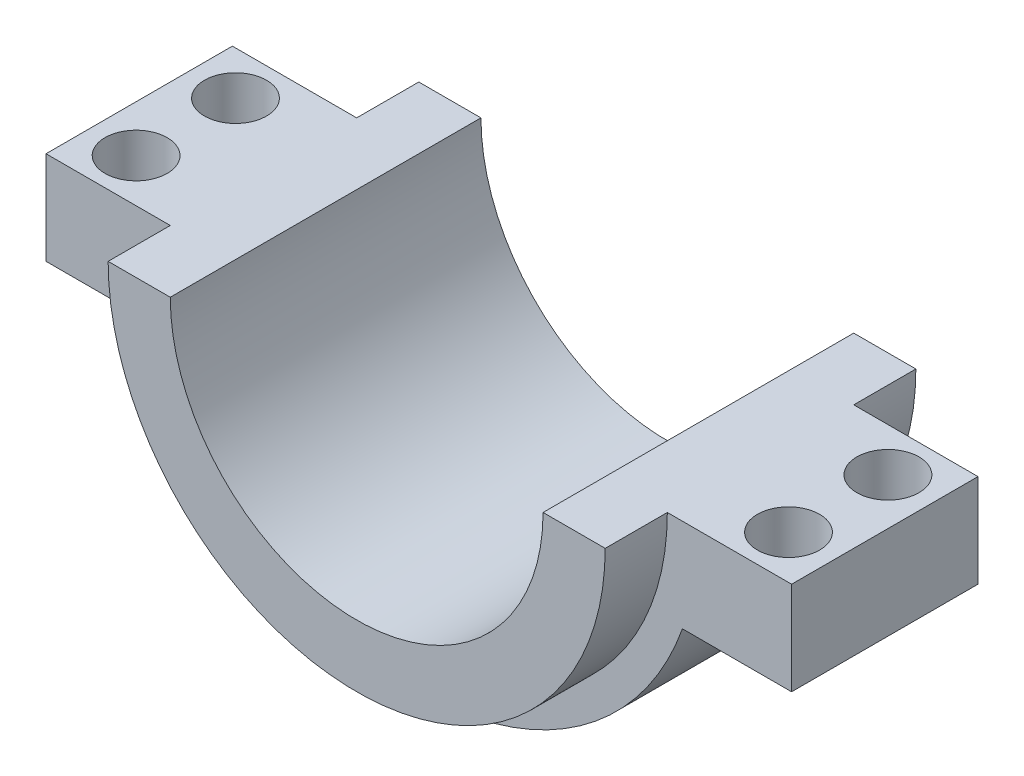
ISO-10303-21;
HEADER;
FILE_DESCRIPTION(('STEP AP214'),'2;1');
FILE_NAME('part.step','',(''),(''),'','','');
FILE_SCHEMA(('AUTOMOTIVE_DESIGN { 1 0 10303 214 1 1 1 1 }'));
ENDSEC;
DATA;
#1=APPLICATION_CONTEXT('core data for automotive mechanical design processes');
#2=APPLICATION_PROTOCOL_DEFINITION('international standard','automotive_design',2000,#1);
#3=PRODUCT_CONTEXT('',#1,'mechanical');
#4=PRODUCT('Part','Part','',(#3));
#5=PRODUCT_RELATED_PRODUCT_CATEGORY('part','',(#4));
#6=PRODUCT_DEFINITION_FORMATION('','',#4);
#7=PRODUCT_DEFINITION_CONTEXT('part definition',#1,'design');
#8=PRODUCT_DEFINITION('design','',#6,#7);
#9=PRODUCT_DEFINITION_SHAPE('','',#8);
#10=(LENGTH_UNIT() NAMED_UNIT(*) SI_UNIT(.MILLI.,.METRE.));
#11=(NAMED_UNIT(*) PLANE_ANGLE_UNIT() SI_UNIT($,.RADIAN.));
#12=(NAMED_UNIT(*) SI_UNIT($,.STERADIAN.) SOLID_ANGLE_UNIT());
#13=UNCERTAINTY_MEASURE_WITH_UNIT(LENGTH_MEASURE(1.E-05),#10,'distance_accuracy_value','');
#14=(GEOMETRIC_REPRESENTATION_CONTEXT(3) GLOBAL_UNCERTAINTY_ASSIGNED_CONTEXT((#13)) GLOBAL_UNIT_ASSIGNED_CONTEXT((#10,
#11,#12)) REPRESENTATION_CONTEXT('',''));
#15=CARTESIAN_POINT('',(0.,0.,0.));
#16=DIRECTION('',(0.,0.,1.));
#17=DIRECTION('',(1.,0.,0.));
#18=AXIS2_PLACEMENT_3D('',#15,#16,#17);
#19=CARTESIAN_POINT('',(0.,0.,15.));
#20=DIRECTION('',(0.,-1.,0.));
#21=DIRECTION('',(1.,0.,0.));
#22=AXIS2_PLACEMENT_3D('',#19,#20,#21);
#23=PLANE('',#22);
#24=CARTESIAN_POINT('',(-52.5,0.,-8.));
#25=DIRECTION('',(0.,1.,0.));
#26=DIRECTION('',(-1.,0.,0.));
#27=AXIS2_PLACEMENT_3D('',#24,#25,#26);
#28=CIRCLE('',#27,5.);
#29=CARTESIAN_POINT('',(-57.5,0.,-8.));
#30=VERTEX_POINT('',#29);
#31=EDGE_CURVE('E160',#30,#30,#28,.T.);
#32=ORIENTED_EDGE('',*,*,#31,.F.);
#33=EDGE_LOOP('',(#32));
#34=FACE_BOUND('',#33,.T.);
#35=CARTESIAN_POINT('',(-52.5,0.,8.));
#36=DIRECTION('',(0.,1.,0.));
#37=DIRECTION('',(-1.,0.,0.));
#38=AXIS2_PLACEMENT_3D('',#35,#36,#37);
#39=CIRCLE('',#38,5.);
#40=CARTESIAN_POINT('',(-57.5,0.,8.));
#41=VERTEX_POINT('',#40);
#42=EDGE_CURVE('E166',#41,#41,#39,.T.);
#43=ORIENTED_EDGE('',*,*,#42,.F.);
#44=EDGE_LOOP('',(#43));
#45=FACE_BOUND('',#44,.T.);
#46=DIRECTION('',(-1.,0.,0.));
#47=VECTOR('',#46,1.);
#48=CARTESIAN_POINT('',(0.,0.,-15.));
#49=LINE('',#48,#47);
#50=CARTESIAN_POINT('',(-40.,0.,-15.));
#51=VERTEX_POINT('',#50);
#52=CARTESIAN_POINT('',(-60.,0.,-15.));
#53=VERTEX_POINT('',#52);
#54=EDGE_CURVE('E137',#51,#53,#49,.T.);
#55=ORIENTED_EDGE('',*,*,#54,.T.);
#56=DIRECTION('',(0.,0.,-1.));
#57=VECTOR('',#56,1.);
#58=CARTESIAN_POINT('',(-60.,0.,15.));
#59=LINE('',#58,#57);
#60=CARTESIAN_POINT('',(-60.,0.,15.));
#61=VERTEX_POINT('',#60);
#62=EDGE_CURVE('E11',#61,#53,#59,.T.);
#63=ORIENTED_EDGE('',*,*,#62,.F.);
#64=DIRECTION('',(-1.,0.,0.));
#65=VECTOR('',#64,1.);
#66=CARTESIAN_POINT('',(0.,0.,15.));
#67=LINE('',#66,#65);
#68=CARTESIAN_POINT('',(-40.,0.,15.));
#69=VERTEX_POINT('',#68);
#70=EDGE_CURVE('E94',#69,#61,#67,.T.);
#71=ORIENTED_EDGE('',*,*,#70,.F.);
#72=DIRECTION('',(0.,0.,-1.));
#73=VECTOR('',#72,1.);
#74=CARTESIAN_POINT('',(-40.,0.,25.));
#75=LINE('',#74,#73);
#76=CARTESIAN_POINT('',(-40.,0.,25.));
#77=VERTEX_POINT('',#76);
#78=EDGE_CURVE('E138',#77,#69,#75,.T.);
#79=ORIENTED_EDGE('',*,*,#78,.F.);
#80=DIRECTION('',(-1.,0.,0.));
#81=VECTOR('',#80,1.);
#82=CARTESIAN_POINT('',(0.,0.,25.));
#83=LINE('',#82,#81);
#84=CARTESIAN_POINT('',(-30.,0.,25.));
#85=VERTEX_POINT('',#84);
#86=EDGE_CURVE('E176',#85,#77,#83,.T.);
#87=ORIENTED_EDGE('',*,*,#86,.F.);
#88=DIRECTION('',(0.,0.,-1.));
#89=VECTOR('',#88,1.);
#90=CARTESIAN_POINT('',(-30.,0.,25.));
#91=LINE('',#90,#89);
#92=CARTESIAN_POINT('',(-30.,0.,-25.));
#93=VERTEX_POINT('',#92);
#94=EDGE_CURVE('E189',#85,#93,#91,.T.);
#95=ORIENTED_EDGE('',*,*,#94,.T.);
#96=DIRECTION('',(-1.,0.,0.));
#97=VECTOR('',#96,1.);
#98=CARTESIAN_POINT('',(0.,0.,-25.));
#99=LINE('',#98,#97);
#100=CARTESIAN_POINT('',(-40.,0.,-25.));
#101=VERTEX_POINT('',#100);
#102=EDGE_CURVE('E164',#93,#101,#99,.T.);
#103=ORIENTED_EDGE('',*,*,#102,.T.);
#104=EDGE_CURVE('E207',#51,#101,#75,.T.);
#105=ORIENTED_EDGE('',*,*,#104,.F.);
#106=EDGE_LOOP('',(#55,#63,#71,#79,#87,#95,#103,#105));
#107=FACE_BOUND('',#106,.T.);
#108=ADVANCED_FACE('F35',(#34,#45,#107),#23,.F.);
#109=CARTESIAN_POINT('',(-60.,0.,15.));
#110=DIRECTION('',(1.,0.,0.));
#111=DIRECTION('',(0.,0.,-1.));
#112=AXIS2_PLACEMENT_3D('',#109,#110,#111);
#113=PLANE('',#112);
#114=DIRECTION('',(0.,-1.,0.));
#115=VECTOR('',#114,1.);
#116=CARTESIAN_POINT('',(-60.,0.,-15.));
#117=LINE('',#116,#115);
#118=CARTESIAN_POINT('',(-60.,-15.,-15.));
#119=VERTEX_POINT('',#118);
#120=EDGE_CURVE('E140',#53,#119,#117,.T.);
#121=ORIENTED_EDGE('',*,*,#120,.T.);
#122=DIRECTION('',(0.,0.,-1.));
#123=VECTOR('',#122,1.);
#124=CARTESIAN_POINT('',(-60.,-15.,15.));
#125=LINE('',#124,#123);
#126=CARTESIAN_POINT('',(-60.,-15.,15.));
#127=VERTEX_POINT('',#126);
#128=EDGE_CURVE('E44',#127,#119,#125,.T.);
#129=ORIENTED_EDGE('',*,*,#128,.F.);
#130=DIRECTION('',(0.,-1.,0.));
#131=VECTOR('',#130,1.);
#132=CARTESIAN_POINT('',(-60.,0.,15.));
#133=LINE('',#132,#131);
#134=EDGE_CURVE('E213',#61,#127,#133,.T.);
#135=ORIENTED_EDGE('',*,*,#134,.F.);
#136=ORIENTED_EDGE('',*,*,#62,.T.);
#137=EDGE_LOOP('',(#121,#129,#135,#136));
#138=FACE_BOUND('',#137,.T.);
#139=ADVANCED_FACE('F217',(#138),#113,.F.);
#140=CARTESIAN_POINT('',(0.,-15.,15.));
#141=DIRECTION('',(0.,1.,0.));
#142=DIRECTION('',(0.,0.,1.));
#143=AXIS2_PLACEMENT_3D('',#140,#141,#142);
#144=PLANE('',#143);
#145=CARTESIAN_POINT('',(-52.5,-15.,-8.));
#146=DIRECTION('',(0.,1.,0.));
#147=DIRECTION('',(0.,0.,1.));
#148=AXIS2_PLACEMENT_3D('',#145,#146,#147);
#149=CIRCLE('',#148,5.);
#150=CARTESIAN_POINT('',(-52.5,-15.,-3.));
#151=VERTEX_POINT('',#150);
#152=EDGE_CURVE('E38',#151,#151,#149,.T.);
#153=ORIENTED_EDGE('',*,*,#152,.T.);
#154=EDGE_LOOP('',(#153));
#155=FACE_BOUND('',#154,.T.);
#156=CARTESIAN_POINT('',(-52.5,-15.,8.));
#157=DIRECTION('',(0.,1.,0.));
#158=DIRECTION('',(0.,0.,1.));
#159=AXIS2_PLACEMENT_3D('',#156,#157,#158);
#160=CIRCLE('',#159,5.);
#161=CARTESIAN_POINT('',(-52.5,-15.,13.));
#162=VERTEX_POINT('',#161);
#163=EDGE_CURVE('E158',#162,#162,#160,.T.);
#164=ORIENTED_EDGE('',*,*,#163,.T.);
#165=EDGE_LOOP('',(#164));
#166=FACE_BOUND('',#165,.T.);
#167=DIRECTION('',(1.,0.,0.));
#168=VECTOR('',#167,1.);
#169=CARTESIAN_POINT('',(0.,-15.,-15.));
#170=LINE('',#169,#168);
#171=CARTESIAN_POINT('',(-42.4264068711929,-15.,-15.));
#172=VERTEX_POINT('',#171);
#173=EDGE_CURVE('E142',#119,#172,#170,.T.);
#174=ORIENTED_EDGE('',*,*,#173,.T.);
#175=DIRECTION('',(0.,0.,-1.));
#176=VECTOR('',#175,1.);
#177=CARTESIAN_POINT('',(-42.4264068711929,-15.,15.));
#178=LINE('',#177,#176);
#179=CARTESIAN_POINT('',(-42.4264068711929,-15.,15.));
#180=VERTEX_POINT('',#179);
#181=EDGE_CURVE('E124',#180,#172,#178,.T.);
#182=ORIENTED_EDGE('',*,*,#181,.F.);
#183=DIRECTION('',(1.,0.,0.));
#184=VECTOR('',#183,1.);
#185=CARTESIAN_POINT('',(0.,-15.,15.));
#186=LINE('',#185,#184);
#187=EDGE_CURVE('E111',#127,#180,#186,.T.);
#188=ORIENTED_EDGE('',*,*,#187,.F.);
#189=ORIENTED_EDGE('',*,*,#128,.T.);
#190=EDGE_LOOP('',(#174,#182,#188,#189));
#191=FACE_BOUND('',#190,.T.);
#192=ADVANCED_FACE('F221',(#155,#166,#191),#144,.F.);
#193=CARTESIAN_POINT('',(0.,0.,15.));
#194=DIRECTION('',(0.,0.,-1.));
#195=DIRECTION('',(-1.,0.,0.));
#196=AXIS2_PLACEMENT_3D('',#193,#194,#195);
#197=CYLINDRICAL_SURFACE('',#196,45.);
#198=CARTESIAN_POINT('',(0.,0.,-15.));
#199=DIRECTION('',(0.,0.,1.));
#200=DIRECTION('',(1.,0.,0.));
#201=AXIS2_PLACEMENT_3D('',#198,#199,#200);
#202=CIRCLE('',#201,45.);
#203=CARTESIAN_POINT('',(42.4264068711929,-15.,-15.));
#204=VERTEX_POINT('',#203);
#205=EDGE_CURVE('E120',#172,#204,#202,.T.);
#206=ORIENTED_EDGE('',*,*,#205,.T.);
#207=DIRECTION('',(0.,0.,-1.));
#208=VECTOR('',#207,1.);
#209=CARTESIAN_POINT('',(42.4264068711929,-15.,15.));
#210=LINE('',#209,#208);
#211=CARTESIAN_POINT('',(42.4264068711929,-15.,15.));
#212=VERTEX_POINT('',#211);
#213=EDGE_CURVE('E117',#212,#204,#210,.T.);
#214=ORIENTED_EDGE('',*,*,#213,.F.);
#215=CARTESIAN_POINT('',(0.,0.,15.));
#216=DIRECTION('',(0.,0.,1.));
#217=DIRECTION('',(1.,0.,0.));
#218=AXIS2_PLACEMENT_3D('',#215,#216,#217);
#219=CIRCLE('',#218,45.);
#220=EDGE_CURVE('E105',#180,#212,#219,.T.);
#221=ORIENTED_EDGE('',*,*,#220,.F.);
#222=ORIENTED_EDGE('',*,*,#181,.T.);
#223=EDGE_LOOP('',(#206,#214,#221,#222));
#224=FACE_BOUND('',#223,.T.);
#225=ADVANCED_FACE('F118',(#224),#197,.T.);
#226=CARTESIAN_POINT('',(0.,-15.,15.));
#227=DIRECTION('',(0.,-1.,0.));
#228=DIRECTION('',(0.,0.,-1.));
#229=AXIS2_PLACEMENT_3D('',#226,#227,#228);
#230=PLANE('',#229);
#231=CARTESIAN_POINT('',(52.5,-15.,-8.));
#232=DIRECTION('',(0.,-1.,0.));
#233=DIRECTION('',(0.,0.,-1.));
#234=AXIS2_PLACEMENT_3D('',#231,#232,#233);
#235=CIRCLE('',#234,5.);
#236=CARTESIAN_POINT('',(52.5,-15.,-13.));
#237=VERTEX_POINT('',#236);
#238=EDGE_CURVE('E171',#237,#237,#235,.F.);
#239=ORIENTED_EDGE('',*,*,#238,.T.);
#240=EDGE_LOOP('',(#239));
#241=FACE_BOUND('',#240,.T.);
#242=CARTESIAN_POINT('',(52.5,-15.,8.));
#243=DIRECTION('',(0.,-1.,0.));
#244=DIRECTION('',(0.,0.,-1.));
#245=AXIS2_PLACEMENT_3D('',#242,#243,#244);
#246=CIRCLE('',#245,5.);
#247=CARTESIAN_POINT('',(52.5,-15.,3.));
#248=VERTEX_POINT('',#247);
#249=EDGE_CURVE('E313',#248,#248,#246,.F.);
#250=ORIENTED_EDGE('',*,*,#249,.T.);
#251=EDGE_LOOP('',(#250));
#252=FACE_BOUND('',#251,.T.);
#253=DIRECTION('',(-1.,0.,0.));
#254=VECTOR('',#253,1.);
#255=CARTESIAN_POINT('',(0.,-15.,-15.));
#256=LINE('',#255,#254);
#257=CARTESIAN_POINT('',(60.,-15.,-15.));
#258=VERTEX_POINT('',#257);
#259=EDGE_CURVE('E145',#258,#204,#256,.T.);
#260=ORIENTED_EDGE('',*,*,#259,.F.);
#261=DIRECTION('',(0.,0.,-1.));
#262=VECTOR('',#261,1.);
#263=CARTESIAN_POINT('',(60.,-15.,15.));
#264=LINE('',#263,#262);
#265=CARTESIAN_POINT('',(60.,-15.,15.));
#266=VERTEX_POINT('',#265);
#267=EDGE_CURVE('E125',#266,#258,#264,.T.);
#268=ORIENTED_EDGE('',*,*,#267,.F.);
#269=DIRECTION('',(-1.,0.,0.));
#270=VECTOR('',#269,1.);
#271=CARTESIAN_POINT('',(0.,-15.,15.));
#272=LINE('',#271,#270);
#273=EDGE_CURVE('E109',#266,#212,#272,.T.);
#274=ORIENTED_EDGE('',*,*,#273,.T.);
#275=ORIENTED_EDGE('',*,*,#213,.T.);
#276=EDGE_LOOP('',(#260,#268,#274,#275));
#277=FACE_BOUND('',#276,.T.);
#278=ADVANCED_FACE('F127',(#241,#252,#277),#230,.T.);
#279=CARTESIAN_POINT('',(60.,0.,15.));
#280=DIRECTION('',(1.,0.,0.));
#281=DIRECTION('',(0.,0.,-1.));
#282=AXIS2_PLACEMENT_3D('',#279,#280,#281);
#283=PLANE('',#282);
#284=DIRECTION('',(0.,-1.,0.));
#285=VECTOR('',#284,1.);
#286=CARTESIAN_POINT('',(60.,0.,-15.));
#287=LINE('',#286,#285);
#288=CARTESIAN_POINT('',(60.,0.,-15.));
#289=VERTEX_POINT('',#288);
#290=EDGE_CURVE('E147',#289,#258,#287,.T.);
#291=ORIENTED_EDGE('',*,*,#290,.F.);
#292=DIRECTION('',(0.,0.,-1.));
#293=VECTOR('',#292,1.);
#294=CARTESIAN_POINT('',(60.,0.,15.));
#295=LINE('',#294,#293);
#296=CARTESIAN_POINT('',(60.,0.,15.));
#297=VERTEX_POINT('',#296);
#298=EDGE_CURVE('E53',#297,#289,#295,.T.);
#299=ORIENTED_EDGE('',*,*,#298,.F.);
#300=DIRECTION('',(0.,-1.,0.));
#301=VECTOR('',#300,1.);
#302=CARTESIAN_POINT('',(60.,0.,15.));
#303=LINE('',#302,#301);
#304=EDGE_CURVE('E128',#297,#266,#303,.T.);
#305=ORIENTED_EDGE('',*,*,#304,.T.);
#306=ORIENTED_EDGE('',*,*,#267,.T.);
#307=EDGE_LOOP('',(#291,#299,#305,#306));
#308=FACE_BOUND('',#307,.T.);
#309=ADVANCED_FACE('F224',(#308),#283,.T.);
#310=CARTESIAN_POINT('',(0.,0.,15.));
#311=DIRECTION('',(0.,1.,0.));
#312=DIRECTION('',(-1.,0.,0.));
#313=AXIS2_PLACEMENT_3D('',#310,#311,#312);
#314=PLANE('',#313);
#315=CARTESIAN_POINT('',(52.5,0.,-8.));
#316=DIRECTION('',(0.,-1.,0.));
#317=DIRECTION('',(1.,0.,0.));
#318=AXIS2_PLACEMENT_3D('',#315,#316,#317);
#319=CIRCLE('',#318,5.);
#320=CARTESIAN_POINT('',(57.5,0.,-8.));
#321=VERTEX_POINT('',#320);
#322=EDGE_CURVE('E311',#321,#321,#319,.T.);
#323=ORIENTED_EDGE('',*,*,#322,.T.);
#324=EDGE_LOOP('',(#323));
#325=FACE_BOUND('',#324,.T.);
#326=CARTESIAN_POINT('',(52.5,0.,8.));
#327=DIRECTION('',(0.,-1.,0.));
#328=DIRECTION('',(1.,0.,0.));
#329=AXIS2_PLACEMENT_3D('',#326,#327,#328);
#330=CIRCLE('',#329,5.);
#331=CARTESIAN_POINT('',(57.5,0.,8.));
#332=VERTEX_POINT('',#331);
#333=EDGE_CURVE('E314',#332,#332,#330,.T.);
#334=ORIENTED_EDGE('',*,*,#333,.T.);
#335=EDGE_LOOP('',(#334));
#336=FACE_BOUND('',#335,.T.);
#337=DIRECTION('',(1.,0.,0.));
#338=VECTOR('',#337,1.);
#339=CARTESIAN_POINT('',(0.,0.,-15.));
#340=LINE('',#339,#338);
#341=CARTESIAN_POINT('',(40.,0.,-15.));
#342=VERTEX_POINT('',#341);
#343=EDGE_CURVE('E150',#342,#289,#340,.T.);
#344=ORIENTED_EDGE('',*,*,#343,.F.);
#345=DIRECTION('',(0.,0.,-1.));
#346=VECTOR('',#345,1.);
#347=CARTESIAN_POINT('',(40.,0.,25.));
#348=LINE('',#347,#346);
#349=CARTESIAN_POINT('',(40.,0.,-25.));
#350=VERTEX_POINT('',#349);
#351=EDGE_CURVE('E85',#342,#350,#348,.T.);
#352=ORIENTED_EDGE('',*,*,#351,.T.);
#353=DIRECTION('',(1.,0.,0.));
#354=VECTOR('',#353,1.);
#355=CARTESIAN_POINT('',(0.,0.,-25.));
#356=LINE('',#355,#354);
#357=CARTESIAN_POINT('',(30.,0.,-25.));
#358=VERTEX_POINT('',#357);
#359=EDGE_CURVE('E194',#358,#350,#356,.T.);
#360=ORIENTED_EDGE('',*,*,#359,.F.);
#361=DIRECTION('',(0.,0.,-1.));
#362=VECTOR('',#361,1.);
#363=CARTESIAN_POINT('',(30.,0.,25.));
#364=LINE('',#363,#362);
#365=CARTESIAN_POINT('',(30.,0.,25.));
#366=VERTEX_POINT('',#365);
#367=EDGE_CURVE('E201',#366,#358,#364,.T.);
#368=ORIENTED_EDGE('',*,*,#367,.F.);
#369=DIRECTION('',(1.,0.,0.));
#370=VECTOR('',#369,1.);
#371=CARTESIAN_POINT('',(0.,0.,25.));
#372=LINE('',#371,#370);
#373=CARTESIAN_POINT('',(40.,0.,25.));
#374=VERTEX_POINT('',#373);
#375=EDGE_CURVE('E183',#366,#374,#372,.T.);
#376=ORIENTED_EDGE('',*,*,#375,.T.);
#377=CARTESIAN_POINT('',(40.,0.,15.));
#378=VERTEX_POINT('',#377);
#379=EDGE_CURVE('E204',#374,#378,#348,.T.);
#380=ORIENTED_EDGE('',*,*,#379,.T.);
#381=DIRECTION('',(1.,0.,0.));
#382=VECTOR('',#381,1.);
#383=CARTESIAN_POINT('',(0.,0.,15.));
#384=LINE('',#383,#382);
#385=EDGE_CURVE('E130',#378,#297,#384,.T.);
#386=ORIENTED_EDGE('',*,*,#385,.T.);
#387=ORIENTED_EDGE('',*,*,#298,.T.);
#388=EDGE_LOOP('',(#344,#352,#360,#368,#376,#380,#386,#387));
#389=FACE_BOUND('',#388,.T.);
#390=ADVANCED_FACE('F227',(#325,#336,#389),#314,.T.);
#391=CARTESIAN_POINT('',(0.,0.,15.));
#392=DIRECTION('',(0.,0.,1.));
#393=DIRECTION('',(1.,0.,0.));
#394=AXIS2_PLACEMENT_3D('',#391,#392,#393);
#395=PLANE('',#394);
#396=CARTESIAN_POINT('',(0.,0.,15.));
#397=DIRECTION('',(0.,0.,1.));
#398=DIRECTION('',(1.,0.,0.));
#399=AXIS2_PLACEMENT_3D('',#396,#397,#398);
#400=CIRCLE('',#399,40.);
#401=EDGE_CURVE('E153',#69,#378,#400,.T.);
#402=ORIENTED_EDGE('',*,*,#401,.F.);
#403=ORIENTED_EDGE('',*,*,#70,.T.);
#404=ORIENTED_EDGE('',*,*,#134,.T.);
#405=ORIENTED_EDGE('',*,*,#187,.T.);
#406=ORIENTED_EDGE('',*,*,#220,.T.);
#407=ORIENTED_EDGE('',*,*,#273,.F.);
#408=ORIENTED_EDGE('',*,*,#304,.F.);
#409=ORIENTED_EDGE('',*,*,#385,.F.);
#410=EDGE_LOOP('',(#402,#403,#404,#405,#406,#407,#408,#409));
#411=FACE_BOUND('',#410,.T.);
#412=ADVANCED_FACE('F107',(#411),#395,.T.);
#413=CARTESIAN_POINT('',(0.,0.,-15.));
#414=DIRECTION('',(0.,0.,1.));
#415=DIRECTION('',(1.,0.,0.));
#416=AXIS2_PLACEMENT_3D('',#413,#414,#415);
#417=PLANE('',#416);
#418=CARTESIAN_POINT('',(0.,0.,-15.));
#419=DIRECTION('',(0.,0.,1.));
#420=DIRECTION('',(1.,0.,0.));
#421=AXIS2_PLACEMENT_3D('',#418,#419,#420);
#422=CIRCLE('',#421,40.);
#423=EDGE_CURVE('E135',#51,#342,#422,.T.);
#424=ORIENTED_EDGE('',*,*,#423,.T.);
#425=ORIENTED_EDGE('',*,*,#343,.T.);
#426=ORIENTED_EDGE('',*,*,#290,.T.);
#427=ORIENTED_EDGE('',*,*,#259,.T.);
#428=ORIENTED_EDGE('',*,*,#205,.F.);
#429=ORIENTED_EDGE('',*,*,#173,.F.);
#430=ORIENTED_EDGE('',*,*,#120,.F.);
#431=ORIENTED_EDGE('',*,*,#54,.F.);
#432=EDGE_LOOP('',(#424,#425,#426,#427,#428,#429,#430,#431));
#433=FACE_BOUND('',#432,.T.);
#434=ADVANCED_FACE('F223',(#433),#417,.F.);
#435=CARTESIAN_POINT('',(0.,0.,25.));
#436=DIRECTION('',(0.,0.,-1.));
#437=DIRECTION('',(-1.,0.,0.));
#438=AXIS2_PLACEMENT_3D('',#435,#436,#437);
#439=CYLINDRICAL_SURFACE('',#438,40.);
#440=ORIENTED_EDGE('',*,*,#351,.F.);
#441=ORIENTED_EDGE('',*,*,#423,.F.);
#442=ORIENTED_EDGE('',*,*,#104,.T.);
#443=CARTESIAN_POINT('',(0.,0.,-25.));
#444=DIRECTION('',(0.,0.,1.));
#445=DIRECTION('',(1.,0.,0.));
#446=AXIS2_PLACEMENT_3D('',#443,#444,#445);
#447=CIRCLE('',#446,40.);
#448=EDGE_CURVE('E192',#101,#350,#447,.T.);
#449=ORIENTED_EDGE('',*,*,#448,.T.);
#450=EDGE_LOOP('',(#440,#441,#442,#449));
#451=FACE_BOUND('',#450,.T.);
#452=ADVANCED_FACE('F257',(#451),#439,.T.);
#453=ORIENTED_EDGE('',*,*,#401,.T.);
#454=ORIENTED_EDGE('',*,*,#379,.F.);
#455=CARTESIAN_POINT('',(0.,0.,25.));
#456=DIRECTION('',(0.,0.,1.));
#457=DIRECTION('',(1.,0.,0.));
#458=AXIS2_PLACEMENT_3D('',#455,#456,#457);
#459=CIRCLE('',#458,40.);
#460=EDGE_CURVE('E179',#77,#374,#459,.T.);
#461=ORIENTED_EDGE('',*,*,#460,.F.);
#462=ORIENTED_EDGE('',*,*,#78,.T.);
#463=EDGE_LOOP('',(#453,#454,#461,#462));
#464=FACE_BOUND('',#463,.T.);
#465=ADVANCED_FACE('F237',(#464),#439,.T.);
#466=CARTESIAN_POINT('',(0.,0.,25.));
#467=DIRECTION('',(0.,0.,-1.));
#468=DIRECTION('',(-1.,0.,0.));
#469=AXIS2_PLACEMENT_3D('',#466,#467,#468);
#470=CYLINDRICAL_SURFACE('',#469,30.);
#471=CARTESIAN_POINT('',(0.,0.,-25.));
#472=DIRECTION('',(0.,0.,1.));
#473=DIRECTION('',(1.,0.,0.));
#474=AXIS2_PLACEMENT_3D('',#471,#472,#473);
#475=CIRCLE('',#474,30.);
#476=EDGE_CURVE('E180',#93,#358,#475,.T.);
#477=ORIENTED_EDGE('',*,*,#476,.F.);
#478=ORIENTED_EDGE('',*,*,#94,.F.);
#479=CARTESIAN_POINT('',(0.,0.,25.));
#480=DIRECTION('',(0.,0.,1.));
#481=DIRECTION('',(1.,0.,0.));
#482=AXIS2_PLACEMENT_3D('',#479,#480,#481);
#483=CIRCLE('',#482,30.);
#484=EDGE_CURVE('E186',#85,#366,#483,.T.);
#485=ORIENTED_EDGE('',*,*,#484,.T.);
#486=ORIENTED_EDGE('',*,*,#367,.T.);
#487=EDGE_LOOP('',(#477,#478,#485,#486));
#488=FACE_BOUND('',#487,.T.);
#489=ADVANCED_FACE('F267',(#488),#470,.F.);
#490=CARTESIAN_POINT('',(0.,0.,25.));
#491=DIRECTION('',(0.,0.,1.));
#492=DIRECTION('',(1.,0.,0.));
#493=AXIS2_PLACEMENT_3D('',#490,#491,#492);
#494=PLANE('',#493);
#495=ORIENTED_EDGE('',*,*,#86,.T.);
#496=ORIENTED_EDGE('',*,*,#460,.T.);
#497=ORIENTED_EDGE('',*,*,#375,.F.);
#498=ORIENTED_EDGE('',*,*,#484,.F.);
#499=EDGE_LOOP('',(#495,#496,#497,#498));
#500=FACE_BOUND('',#499,.T.);
#501=ADVANCED_FACE('F270',(#500),#494,.T.);
#502=CARTESIAN_POINT('',(0.,0.,-25.));
#503=DIRECTION('',(0.,0.,1.));
#504=DIRECTION('',(1.,0.,0.));
#505=AXIS2_PLACEMENT_3D('',#502,#503,#504);
#506=PLANE('',#505);
#507=ORIENTED_EDGE('',*,*,#102,.F.);
#508=ORIENTED_EDGE('',*,*,#476,.T.);
#509=ORIENTED_EDGE('',*,*,#359,.T.);
#510=ORIENTED_EDGE('',*,*,#448,.F.);
#511=EDGE_LOOP('',(#507,#508,#509,#510));
#512=FACE_BOUND('',#511,.T.);
#513=ADVANCED_FACE('F265',(#512),#506,.F.);
#514=CARTESIAN_POINT('',(-52.5,-45.,8.));
#515=DIRECTION('',(0.,1.,0.));
#516=DIRECTION('',(-1.,0.,0.));
#517=AXIS2_PLACEMENT_3D('',#514,#515,#516);
#518=CYLINDRICAL_SURFACE('',#517,5.);
#519=ORIENTED_EDGE('',*,*,#42,.T.);
#520=EDGE_LOOP('',(#519));
#521=FACE_BOUND('',#520,.T.);
#522=ORIENTED_EDGE('',*,*,#163,.F.);
#523=EDGE_LOOP('',(#522));
#524=FACE_BOUND('',#523,.T.);
#525=ADVANCED_FACE('F277',(#521,#524),#518,.F.);
#526=CARTESIAN_POINT('',(-52.5,-45.,-8.));
#527=DIRECTION('',(0.,1.,0.));
#528=DIRECTION('',(-1.,0.,0.));
#529=AXIS2_PLACEMENT_3D('',#526,#527,#528);
#530=CYLINDRICAL_SURFACE('',#529,5.);
#531=ORIENTED_EDGE('',*,*,#31,.T.);
#532=EDGE_LOOP('',(#531));
#533=FACE_BOUND('',#532,.T.);
#534=ORIENTED_EDGE('',*,*,#152,.F.);
#535=EDGE_LOOP('',(#534));
#536=FACE_BOUND('',#535,.T.);
#537=ADVANCED_FACE('F291',(#533,#536),#530,.F.);
#538=CARTESIAN_POINT('',(52.5,-45.,8.));
#539=DIRECTION('',(0.,1.,0.));
#540=DIRECTION('',(-1.,0.,0.));
#541=AXIS2_PLACEMENT_3D('',#538,#539,#540);
#542=CYLINDRICAL_SURFACE('',#541,5.);
#543=ORIENTED_EDGE('',*,*,#249,.F.);
#544=EDGE_LOOP('',(#543));
#545=FACE_BOUND('',#544,.T.);
#546=ORIENTED_EDGE('',*,*,#333,.F.);
#547=EDGE_LOOP('',(#546));
#548=FACE_BOUND('',#547,.T.);
#549=ADVANCED_FACE('F295',(#545,#548),#542,.F.);
#550=CARTESIAN_POINT('',(52.5,-45.,-8.));
#551=DIRECTION('',(0.,1.,0.));
#552=DIRECTION('',(-1.,0.,0.));
#553=AXIS2_PLACEMENT_3D('',#550,#551,#552);
#554=CYLINDRICAL_SURFACE('',#553,5.);
#555=ORIENTED_EDGE('',*,*,#238,.F.);
#556=EDGE_LOOP('',(#555));
#557=FACE_BOUND('',#556,.T.);
#558=ORIENTED_EDGE('',*,*,#322,.F.);
#559=EDGE_LOOP('',(#558));
#560=FACE_BOUND('',#559,.T.);
#561=ADVANCED_FACE('F300',(#557,#560),#554,.F.);
#562=CLOSED_SHELL('',(#108,#139,#192,#225,#278,#309,#390,#412,#434,#452,#465,#489,#501,#513,
#525,#537,#549,#561));
#563=MANIFOLD_SOLID_BREP('B2',#562);
#564=ADVANCED_BREP_SHAPE_REPRESENTATION('',(#18,#563),#14);
#565=SHAPE_DEFINITION_REPRESENTATION(#9,#564);
ENDSEC;
END-ISO-10303-21;
